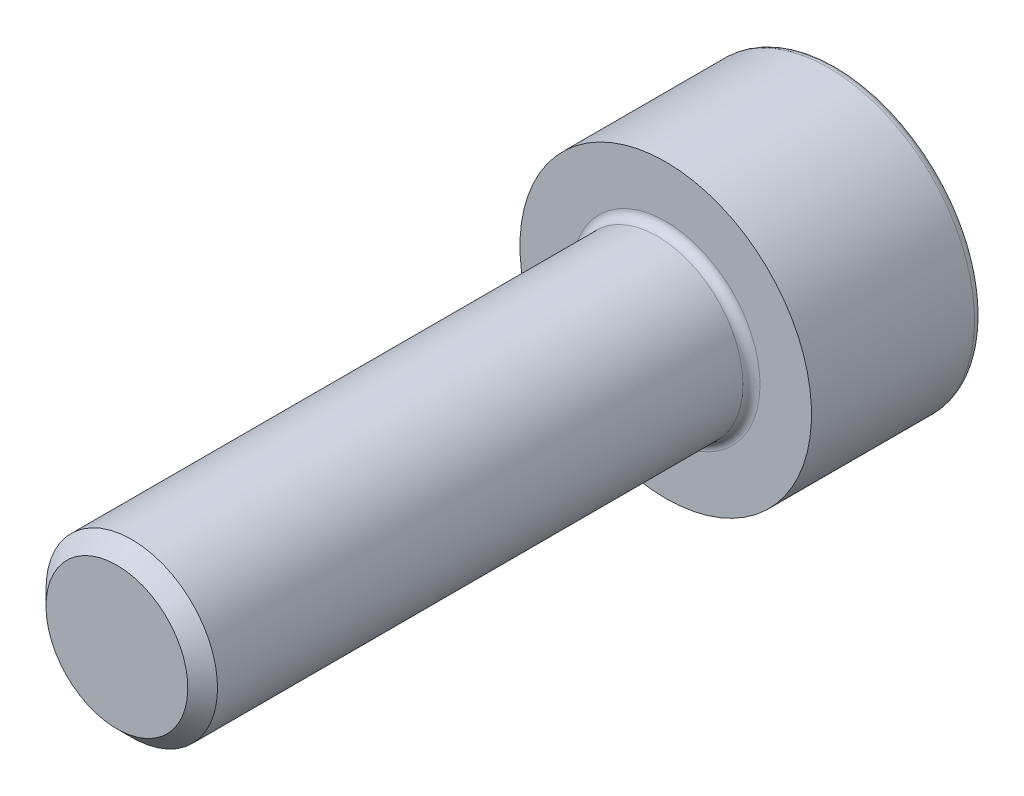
ISO-10303-21;
HEADER;
FILE_DESCRIPTION(('STEP AP214'),'2;1');
FILE_NAME('part.step','',(''),(''),'','','');
FILE_SCHEMA(('AUTOMOTIVE_DESIGN { 1 0 10303 214 1 1 1 1 }'));
ENDSEC;
DATA;
#1=APPLICATION_CONTEXT('core data for automotive mechanical design processes');
#2=APPLICATION_PROTOCOL_DEFINITION('international standard','automotive_design',2000,#1);
#3=PRODUCT_CONTEXT('',#1,'mechanical');
#4=PRODUCT('Part','Part','',(#3));
#5=PRODUCT_RELATED_PRODUCT_CATEGORY('part','',(#4));
#6=PRODUCT_DEFINITION_FORMATION('','',#4);
#7=PRODUCT_DEFINITION_CONTEXT('part definition',#1,'design');
#8=PRODUCT_DEFINITION('design','',#6,#7);
#9=PRODUCT_DEFINITION_SHAPE('','',#8);
#10=(LENGTH_UNIT() NAMED_UNIT(*) SI_UNIT(.MILLI.,.METRE.));
#11=(NAMED_UNIT(*) PLANE_ANGLE_UNIT() SI_UNIT($,.RADIAN.));
#12=(NAMED_UNIT(*) SI_UNIT($,.STERADIAN.) SOLID_ANGLE_UNIT());
#13=UNCERTAINTY_MEASURE_WITH_UNIT(LENGTH_MEASURE(1.E-05),#10,'distance_accuracy_value','');
#14=(GEOMETRIC_REPRESENTATION_CONTEXT(3) GLOBAL_UNCERTAINTY_ASSIGNED_CONTEXT((#13)) GLOBAL_UNIT_ASSIGNED_CONTEXT((#10,
#11,#12)) REPRESENTATION_CONTEXT('',''));
#15=CARTESIAN_POINT('',(0.,0.,0.));
#16=DIRECTION('',(0.,0.,1.));
#17=DIRECTION('',(1.,0.,0.));
#18=AXIS2_PLACEMENT_3D('',#15,#16,#17);
#19=CARTESIAN_POINT('',(0.,2.5,16.));
#20=DIRECTION('',(0.,0.,1.));
#21=DIRECTION('',(0.,-1.,0.));
#22=AXIS2_PLACEMENT_3D('',#19,#20,#21);
#23=PLANE('',#22);
#24=CARTESIAN_POINT('',(0.,0.,16.));
#25=DIRECTION('',(0.,0.,1.));
#26=DIRECTION('',(0.,-1.,0.));
#27=AXIS2_PLACEMENT_3D('',#24,#25,#26);
#28=CIRCLE('',#27,2.067);
#29=CARTESIAN_POINT('',(0.,2.06699999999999,16.));
#30=VERTEX_POINT('',#29);
#31=EDGE_CURVE('E11',#30,#30,#28,.T.);
#32=ORIENTED_EDGE('',*,*,#31,.T.);
#33=EDGE_LOOP('',(#32));
#34=FACE_BOUND('',#33,.T.);
#35=ADVANCED_FACE('F33',(#34),#23,.T.);
#36=CARTESIAN_POINT('',(0.,0.,-5.));
#37=DIRECTION('',(0.,0.,-1.));
#38=DIRECTION('',(0.,1.,0.));
#39=AXIS2_PLACEMENT_3D('',#36,#37,#38);
#40=CYLINDRICAL_SURFACE('',#39,2.5);
#41=CARTESIAN_POINT('',(0.,0.,15.567));
#42=DIRECTION('',(0.,0.,1.));
#43=DIRECTION('',(0.,-1.,0.));
#44=AXIS2_PLACEMENT_3D('',#41,#42,#43);
#45=CIRCLE('',#44,2.5);
#46=CARTESIAN_POINT('',(0.,2.5,15.567));
#47=VERTEX_POINT('',#46);
#48=EDGE_CURVE('E40',#47,#47,#45,.F.);
#49=ORIENTED_EDGE('',*,*,#48,.T.);
#50=EDGE_LOOP('',(#49));
#51=FACE_BOUND('',#50,.T.);
#52=CARTESIAN_POINT('',(0.,0.,0.249999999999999));
#53=DIRECTION('',(0.,0.,1.));
#54=DIRECTION('',(0.,-1.,0.));
#55=AXIS2_PLACEMENT_3D('',#52,#53,#54);
#56=CIRCLE('',#55,2.5);
#57=CARTESIAN_POINT('',(0.,-2.5,0.249999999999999));
#58=VERTEX_POINT('',#57);
#59=EDGE_CURVE('E183',#58,#58,#56,.T.);
#60=ORIENTED_EDGE('',*,*,#59,.T.);
#61=EDGE_LOOP('',(#60));
#62=FACE_BOUND('',#61,.T.);
#63=ADVANCED_FACE('F194',(#51,#62),#40,.T.);
#64=CARTESIAN_POINT('',(0.,4.25,0.));
#65=DIRECTION('',(0.,0.,1.));
#66=DIRECTION('',(0.,-1.,0.));
#67=AXIS2_PLACEMENT_3D('',#64,#65,#66);
#68=PLANE('',#67);
#69=CARTESIAN_POINT('',(0.,0.,0.));
#70=DIRECTION('',(0.,0.,1.));
#71=DIRECTION('',(0.,-1.,0.));
#72=AXIS2_PLACEMENT_3D('',#69,#70,#71);
#73=CIRCLE('',#72,2.75);
#74=CARTESIAN_POINT('',(0.,-2.75,0.));
#75=VERTEX_POINT('',#74);
#76=EDGE_CURVE('E180',#75,#75,#73,.F.);
#77=ORIENTED_EDGE('',*,*,#76,.T.);
#78=EDGE_LOOP('',(#77));
#79=FACE_BOUND('',#78,.T.);
#80=CARTESIAN_POINT('',(0.,0.,0.));
#81=DIRECTION('',(0.,0.,-1.));
#82=DIRECTION('',(0.,1.,0.));
#83=AXIS2_PLACEMENT_3D('',#80,#81,#82);
#84=CIRCLE('',#83,4.25);
#85=CARTESIAN_POINT('',(0.,4.25,0.));
#86=VERTEX_POINT('',#85);
#87=EDGE_CURVE('E176',#86,#86,#84,.T.);
#88=ORIENTED_EDGE('',*,*,#87,.F.);
#89=EDGE_LOOP('',(#88));
#90=FACE_BOUND('',#89,.T.);
#91=ADVANCED_FACE('F214',(#79,#90),#68,.T.);
#92=CARTESIAN_POINT('',(0.,0.,-5.));
#93=DIRECTION('',(0.,0.,-1.));
#94=DIRECTION('',(0.,1.,0.));
#95=AXIS2_PLACEMENT_3D('',#92,#93,#94);
#96=CYLINDRICAL_SURFACE('',#95,4.25);
#97=CARTESIAN_POINT('',(0.,0.,-4.75));
#98=DIRECTION('',(0.,0.,-1.));
#99=DIRECTION('',(0.,1.,0.));
#100=AXIS2_PLACEMENT_3D('',#97,#98,#99);
#101=CIRCLE('',#100,4.25);
#102=CARTESIAN_POINT('',(0.,4.25,-4.75));
#103=VERTEX_POINT('',#102);
#104=EDGE_CURVE('E189',#103,#103,#101,.F.);
#105=ORIENTED_EDGE('',*,*,#104,.T.);
#106=EDGE_LOOP('',(#105));
#107=FACE_BOUND('',#106,.T.);
#108=ORIENTED_EDGE('',*,*,#87,.T.);
#109=EDGE_LOOP('',(#108));
#110=FACE_BOUND('',#109,.T.);
#111=ADVANCED_FACE('F218',(#107,#110),#96,.T.);
#112=CARTESIAN_POINT('',(0.,0.,-5.));
#113=DIRECTION('',(0.,0.,-1.));
#114=DIRECTION('',(0.,1.,0.));
#115=AXIS2_PLACEMENT_3D('',#112,#113,#114);
#116=PLANE('',#115);
#117=CARTESIAN_POINT('',(0.,0.,-5.));
#118=DIRECTION('',(0.,0.,-1.));
#119=DIRECTION('',(0.,1.,0.));
#120=AXIS2_PLACEMENT_3D('',#117,#118,#119);
#121=CIRCLE('',#120,4.);
#122=CARTESIAN_POINT('',(0.,4.,-5.));
#123=VERTEX_POINT('',#122);
#124=EDGE_CURVE('E186',#123,#123,#121,.T.);
#125=ORIENTED_EDGE('',*,*,#124,.T.);
#126=EDGE_LOOP('',(#125));
#127=FACE_BOUND('',#126,.T.);
#128=DIRECTION('',(-1.,0.,0.));
#129=VECTOR('',#128,1.);
#130=CARTESIAN_POINT('',(1.15470053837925,-2.,-5.));
#131=LINE('',#130,#129);
#132=CARTESIAN_POINT('',(1.15470053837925,-2.,-5.));
#133=VERTEX_POINT('',#132);
#134=CARTESIAN_POINT('',(-1.15470053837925,-2.,-5.));
#135=VERTEX_POINT('',#134);
#136=EDGE_CURVE('E137',#133,#135,#131,.T.);
#137=ORIENTED_EDGE('',*,*,#136,.F.);
#138=DIRECTION('',(-0.499999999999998,-0.86602540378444,0.));
#139=VECTOR('',#138,1.);
#140=CARTESIAN_POINT('',(2.30940107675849,0.,-5.));
#141=LINE('',#140,#139);
#142=CARTESIAN_POINT('',(2.30940107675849,0.,-5.));
#143=VERTEX_POINT('',#142);
#144=EDGE_CURVE('E132',#143,#133,#141,.T.);
#145=ORIENTED_EDGE('',*,*,#144,.F.);
#146=DIRECTION('',(0.499999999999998,-0.86602540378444,0.));
#147=VECTOR('',#146,1.);
#148=CARTESIAN_POINT('',(1.15470053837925,2.,-5.));
#149=LINE('',#148,#147);
#150=CARTESIAN_POINT('',(1.15470053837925,2.,-5.));
#151=VERTEX_POINT('',#150);
#152=EDGE_CURVE('E130',#151,#143,#149,.T.);
#153=ORIENTED_EDGE('',*,*,#152,.F.);
#154=DIRECTION('',(1.,0.,0.));
#155=VECTOR('',#154,1.);
#156=CARTESIAN_POINT('',(-1.15470053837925,2.,-5.));
#157=LINE('',#156,#155);
#158=CARTESIAN_POINT('',(-1.15470053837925,2.,-5.));
#159=VERTEX_POINT('',#158);
#160=EDGE_CURVE('E115',#159,#151,#157,.T.);
#161=ORIENTED_EDGE('',*,*,#160,.F.);
#162=DIRECTION('',(0.499999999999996,0.866025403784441,0.));
#163=VECTOR('',#162,1.);
#164=CARTESIAN_POINT('',(-2.30940107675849,0.,-5.));
#165=LINE('',#164,#163);
#166=CARTESIAN_POINT('',(-2.30940107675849,0.,-5.));
#167=VERTEX_POINT('',#166);
#168=EDGE_CURVE('E103',#167,#159,#165,.T.);
#169=ORIENTED_EDGE('',*,*,#168,.F.);
#170=DIRECTION('',(-0.499999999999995,0.866025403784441,0.));
#171=VECTOR('',#170,1.);
#172=CARTESIAN_POINT('',(-1.15470053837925,-2.,-5.));
#173=LINE('',#172,#171);
#174=EDGE_CURVE('E140',#135,#167,#173,.T.);
#175=ORIENTED_EDGE('',*,*,#174,.F.);
#176=EDGE_LOOP('',(#137,#145,#153,#161,#169,#175));
#177=FACE_BOUND('',#176,.T.);
#178=ADVANCED_FACE('F128',(#127,#177),#116,.T.);
#179=CARTESIAN_POINT('',(-2.30940107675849,0.,-2.5));
#180=DIRECTION('',(-0.866025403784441,0.499999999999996,0.));
#181=DIRECTION('',(-0.499999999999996,-0.866025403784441,0.));
#182=AXIS2_PLACEMENT_3D('',#179,#180,#181);
#183=PLANE('',#182);
#184=ORIENTED_EDGE('',*,*,#168,.T.);
#185=DIRECTION('',(0.,0.,-1.));
#186=VECTOR('',#185,1.);
#187=CARTESIAN_POINT('',(-1.15470053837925,2.,-2.5));
#188=LINE('',#187,#186);
#189=CARTESIAN_POINT('',(-1.15470053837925,2.,-2.5));
#190=VERTEX_POINT('',#189);
#191=EDGE_CURVE('E107',#190,#159,#188,.T.);
#192=ORIENTED_EDGE('',*,*,#191,.F.);
#193=DIRECTION('',(0.499999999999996,0.866025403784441,0.));
#194=VECTOR('',#193,1.);
#195=CARTESIAN_POINT('',(-2.30940107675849,0.,-2.5));
#196=LINE('',#195,#194);
#197=CARTESIAN_POINT('',(-1.73205080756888,0.99999999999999,-2.5));
#198=VERTEX_POINT('',#197);
#199=EDGE_CURVE('E142',#198,#190,#196,.T.);
#200=ORIENTED_EDGE('',*,*,#199,.F.);
#201=CARTESIAN_POINT('',(-2.30940107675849,0.,-2.5));
#202=VERTEX_POINT('',#201);
#203=EDGE_CURVE('E143',#202,#198,#196,.T.);
#204=ORIENTED_EDGE('',*,*,#203,.F.);
#205=DIRECTION('',(0.,0.,-1.));
#206=VECTOR('',#205,1.);
#207=CARTESIAN_POINT('',(-2.30940107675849,0.,-2.5));
#208=LINE('',#207,#206);
#209=EDGE_CURVE('E111',#202,#167,#208,.T.);
#210=ORIENTED_EDGE('',*,*,#209,.T.);
#211=EDGE_LOOP('',(#184,#192,#200,#204,#210));
#212=FACE_BOUND('',#211,.T.);
#213=ADVANCED_FACE('F105',(#212),#183,.F.);
#214=CARTESIAN_POINT('',(-1.15470053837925,-2.,-2.5));
#215=DIRECTION('',(-0.866025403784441,-0.499999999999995,0.));
#216=DIRECTION('',(0.499999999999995,-0.866025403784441,0.));
#217=AXIS2_PLACEMENT_3D('',#214,#215,#216);
#218=PLANE('',#217);
#219=ORIENTED_EDGE('',*,*,#174,.T.);
#220=ORIENTED_EDGE('',*,*,#209,.F.);
#221=DIRECTION('',(-0.499999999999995,0.866025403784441,0.));
#222=VECTOR('',#221,1.);
#223=CARTESIAN_POINT('',(-1.15470053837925,-2.,-2.5));
#224=LINE('',#223,#222);
#225=CARTESIAN_POINT('',(-1.73205080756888,-0.999999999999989,-2.5));
#226=VERTEX_POINT('',#225);
#227=EDGE_CURVE('E158',#226,#202,#224,.T.);
#228=ORIENTED_EDGE('',*,*,#227,.F.);
#229=CARTESIAN_POINT('',(-1.15470053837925,-2.,-2.5));
#230=VERTEX_POINT('',#229);
#231=EDGE_CURVE('E126',#230,#226,#224,.T.);
#232=ORIENTED_EDGE('',*,*,#231,.F.);
#233=DIRECTION('',(0.,0.,-1.));
#234=VECTOR('',#233,1.);
#235=CARTESIAN_POINT('',(-1.15470053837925,-2.,-2.5));
#236=LINE('',#235,#234);
#237=EDGE_CURVE('E163',#230,#135,#236,.T.);
#238=ORIENTED_EDGE('',*,*,#237,.T.);
#239=EDGE_LOOP('',(#219,#220,#228,#232,#238));
#240=FACE_BOUND('',#239,.T.);
#241=ADVANCED_FACE('F234',(#240),#218,.F.);
#242=CARTESIAN_POINT('',(1.15470053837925,-2.,-2.5));
#243=DIRECTION('',(0.,-1.,0.));
#244=DIRECTION('',(0.,0.,-1.));
#245=AXIS2_PLACEMENT_3D('',#242,#243,#244);
#246=PLANE('',#245);
#247=ORIENTED_EDGE('',*,*,#136,.T.);
#248=ORIENTED_EDGE('',*,*,#237,.F.);
#249=DIRECTION('',(-1.,0.,0.));
#250=VECTOR('',#249,1.);
#251=CARTESIAN_POINT('',(1.15470053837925,-2.,-2.5));
#252=LINE('',#251,#250);
#253=CARTESIAN_POINT('',(0.,-2.,-2.5));
#254=VERTEX_POINT('',#253);
#255=EDGE_CURVE('E154',#254,#230,#252,.T.);
#256=ORIENTED_EDGE('',*,*,#255,.F.);
#257=CARTESIAN_POINT('',(1.15470053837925,-2.,-2.5));
#258=VERTEX_POINT('',#257);
#259=EDGE_CURVE('E155',#258,#254,#252,.T.);
#260=ORIENTED_EDGE('',*,*,#259,.F.);
#261=DIRECTION('',(0.,0.,-1.));
#262=VECTOR('',#261,1.);
#263=CARTESIAN_POINT('',(1.15470053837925,-2.,-2.5));
#264=LINE('',#263,#262);
#265=EDGE_CURVE('E166',#258,#133,#264,.T.);
#266=ORIENTED_EDGE('',*,*,#265,.T.);
#267=EDGE_LOOP('',(#247,#248,#256,#260,#266));
#268=FACE_BOUND('',#267,.T.);
#269=ADVANCED_FACE('F245',(#268),#246,.F.);
#270=CARTESIAN_POINT('',(2.30940107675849,0.,-2.5));
#271=DIRECTION('',(0.86602540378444,-0.499999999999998,0.));
#272=DIRECTION('',(0.499999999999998,0.86602540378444,0.));
#273=AXIS2_PLACEMENT_3D('',#270,#271,#272);
#274=PLANE('',#273);
#275=ORIENTED_EDGE('',*,*,#144,.T.);
#276=ORIENTED_EDGE('',*,*,#265,.F.);
#277=DIRECTION('',(-0.499999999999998,-0.86602540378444,0.));
#278=VECTOR('',#277,1.);
#279=CARTESIAN_POINT('',(2.30940107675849,0.,-2.5));
#280=LINE('',#279,#278);
#281=CARTESIAN_POINT('',(1.73205080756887,-0.999999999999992,-2.5));
#282=VERTEX_POINT('',#281);
#283=EDGE_CURVE('E150',#282,#258,#280,.T.);
#284=ORIENTED_EDGE('',*,*,#283,.F.);
#285=CARTESIAN_POINT('',(2.30940107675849,0.,-2.5));
#286=VERTEX_POINT('',#285);
#287=EDGE_CURVE('E151',#286,#282,#280,.T.);
#288=ORIENTED_EDGE('',*,*,#287,.F.);
#289=DIRECTION('',(0.,0.,-1.));
#290=VECTOR('',#289,1.);
#291=CARTESIAN_POINT('',(2.30940107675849,0.,-2.5));
#292=LINE('',#291,#290);
#293=EDGE_CURVE('E169',#286,#143,#292,.T.);
#294=ORIENTED_EDGE('',*,*,#293,.T.);
#295=EDGE_LOOP('',(#275,#276,#284,#288,#294));
#296=FACE_BOUND('',#295,.T.);
#297=ADVANCED_FACE('F241',(#296),#274,.F.);
#298=CARTESIAN_POINT('',(1.15470053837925,2.,-2.5));
#299=DIRECTION('',(0.86602540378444,0.499999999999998,0.));
#300=DIRECTION('',(-0.499999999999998,0.86602540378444,0.));
#301=AXIS2_PLACEMENT_3D('',#298,#299,#300);
#302=PLANE('',#301);
#303=ORIENTED_EDGE('',*,*,#152,.T.);
#304=ORIENTED_EDGE('',*,*,#293,.F.);
#305=DIRECTION('',(0.499999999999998,-0.86602540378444,0.));
#306=VECTOR('',#305,1.);
#307=CARTESIAN_POINT('',(1.15470053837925,2.,-2.5));
#308=LINE('',#307,#306);
#309=CARTESIAN_POINT('',(1.73205080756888,0.999999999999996,-2.5));
#310=VERTEX_POINT('',#309);
#311=EDGE_CURVE('E148',#310,#286,#308,.T.);
#312=ORIENTED_EDGE('',*,*,#311,.F.);
#313=CARTESIAN_POINT('',(1.15470053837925,2.,-2.5));
#314=VERTEX_POINT('',#313);
#315=EDGE_CURVE('E47',#314,#310,#308,.T.);
#316=ORIENTED_EDGE('',*,*,#315,.F.);
#317=DIRECTION('',(0.,0.,-1.));
#318=VECTOR('',#317,1.);
#319=CARTESIAN_POINT('',(1.15470053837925,2.,-2.5));
#320=LINE('',#319,#318);
#321=EDGE_CURVE('E125',#314,#151,#320,.T.);
#322=ORIENTED_EDGE('',*,*,#321,.T.);
#323=EDGE_LOOP('',(#303,#304,#312,#316,#322));
#324=FACE_BOUND('',#323,.T.);
#325=ADVANCED_FACE('F238',(#324),#302,.F.);
#326=CARTESIAN_POINT('',(-1.15470053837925,2.,-2.5));
#327=DIRECTION('',(0.,1.,0.));
#328=DIRECTION('',(0.,0.,1.));
#329=AXIS2_PLACEMENT_3D('',#326,#327,#328);
#330=PLANE('',#329);
#331=ORIENTED_EDGE('',*,*,#160,.T.);
#332=ORIENTED_EDGE('',*,*,#321,.F.);
#333=DIRECTION('',(1.,0.,0.));
#334=VECTOR('',#333,1.);
#335=CARTESIAN_POINT('',(-1.15470053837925,2.,-2.5));
#336=LINE('',#335,#334);
#337=CARTESIAN_POINT('',(0.,2.,-2.5));
#338=VERTEX_POINT('',#337);
#339=EDGE_CURVE('E146',#338,#314,#336,.T.);
#340=ORIENTED_EDGE('',*,*,#339,.F.);
#341=EDGE_CURVE('E124',#190,#338,#336,.T.);
#342=ORIENTED_EDGE('',*,*,#341,.F.);
#343=ORIENTED_EDGE('',*,*,#191,.T.);
#344=EDGE_LOOP('',(#331,#332,#340,#342,#343));
#345=FACE_BOUND('',#344,.T.);
#346=ADVANCED_FACE('F119',(#345),#330,.F.);
#347=CARTESIAN_POINT('',(-1.15470053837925,2.,-2.5));
#348=DIRECTION('',(0.,0.,-1.));
#349=DIRECTION('',(0.,1.,0.));
#350=AXIS2_PLACEMENT_3D('',#347,#348,#349);
#351=PLANE('',#350);
#352=CARTESIAN_POINT('',(0.,0.,-2.5));
#353=DIRECTION('',(0.,0.,-1.));
#354=DIRECTION('',(0.,1.,0.));
#355=AXIS2_PLACEMENT_3D('',#352,#353,#354);
#356=CIRCLE('',#355,2.);
#357=EDGE_CURVE('E162',#198,#338,#356,.T.);
#358=ORIENTED_EDGE('',*,*,#357,.F.);
#359=ORIENTED_EDGE('',*,*,#199,.T.);
#360=ORIENTED_EDGE('',*,*,#341,.T.);
#361=EDGE_LOOP('',(#358,#359,#360));
#362=FACE_BOUND('',#361,.T.);
#363=ADVANCED_FACE('F237',(#362),#351,.T.);
#364=EDGE_CURVE('E402',#226,#198,#356,.T.);
#365=ORIENTED_EDGE('',*,*,#364,.F.);
#366=ORIENTED_EDGE('',*,*,#227,.T.);
#367=ORIENTED_EDGE('',*,*,#203,.T.);
#368=EDGE_LOOP('',(#365,#366,#367));
#369=FACE_BOUND('',#368,.T.);
#370=ADVANCED_FACE('F255',(#369),#351,.T.);
#371=EDGE_CURVE('E403',#254,#226,#356,.T.);
#372=ORIENTED_EDGE('',*,*,#371,.F.);
#373=ORIENTED_EDGE('',*,*,#255,.T.);
#374=ORIENTED_EDGE('',*,*,#231,.T.);
#375=EDGE_LOOP('',(#372,#373,#374));
#376=FACE_BOUND('',#375,.T.);
#377=ADVANCED_FACE('F351',(#376),#351,.T.);
#378=EDGE_CURVE('E404',#282,#254,#356,.T.);
#379=ORIENTED_EDGE('',*,*,#378,.F.);
#380=ORIENTED_EDGE('',*,*,#283,.T.);
#381=ORIENTED_EDGE('',*,*,#259,.T.);
#382=EDGE_LOOP('',(#379,#380,#381));
#383=FACE_BOUND('',#382,.T.);
#384=ADVANCED_FACE('F359',(#383),#351,.T.);
#385=EDGE_CURVE('E177',#310,#282,#356,.T.);
#386=ORIENTED_EDGE('',*,*,#385,.F.);
#387=ORIENTED_EDGE('',*,*,#311,.T.);
#388=ORIENTED_EDGE('',*,*,#287,.T.);
#389=EDGE_LOOP('',(#386,#387,#388));
#390=FACE_BOUND('',#389,.T.);
#391=ADVANCED_FACE('F367',(#390),#351,.T.);
#392=EDGE_CURVE('E173',#338,#310,#356,.T.);
#393=ORIENTED_EDGE('',*,*,#392,.F.);
#394=ORIENTED_EDGE('',*,*,#339,.T.);
#395=ORIENTED_EDGE('',*,*,#315,.T.);
#396=EDGE_LOOP('',(#393,#394,#395));
#397=FACE_BOUND('',#396,.T.);
#398=ADVANCED_FACE('F231',(#397),#351,.T.);
#399=CARTESIAN_POINT('',(0.,0.,-2.5));
#400=DIRECTION('',(0.,0.,-1.));
#401=DIRECTION('',(0.,1.,0.));
#402=AXIS2_PLACEMENT_3D('',#399,#400,#401);
#403=CONICAL_SURFACE('',#402,2.,1.0471975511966);
#404=CARTESIAN_POINT('',(0.,0.,-1.34529946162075));
#405=VERTEX_POINT('',#404);
#406=VERTEX_LOOP('',#405);
#407=FACE_BOUND('',#406,.T.);
#408=ORIENTED_EDGE('',*,*,#392,.T.);
#409=ORIENTED_EDGE('',*,*,#385,.T.);
#410=ORIENTED_EDGE('',*,*,#378,.T.);
#411=ORIENTED_EDGE('',*,*,#371,.T.);
#412=ORIENTED_EDGE('',*,*,#364,.T.);
#413=ORIENTED_EDGE('',*,*,#357,.T.);
#414=EDGE_LOOP('',(#408,#409,#410,#411,#412,#413));
#415=FACE_BOUND('',#414,.T.);
#416=ADVANCED_FACE('F228',(#407,#415),#403,.F.);
#417=CARTESIAN_POINT('',(0.,0.,0.249999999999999));
#418=DIRECTION('',(0.,0.,1.));
#419=DIRECTION('',(0.,-1.,0.));
#420=AXIS2_PLACEMENT_3D('',#417,#418,#419);
#421=TOROIDAL_SURFACE('',#420,2.75,0.25);
#422=ORIENTED_EDGE('',*,*,#59,.F.);
#423=EDGE_LOOP('',(#422));
#424=FACE_BOUND('',#423,.T.);
#425=ORIENTED_EDGE('',*,*,#76,.F.);
#426=EDGE_LOOP('',(#425));
#427=FACE_BOUND('',#426,.T.);
#428=ADVANCED_FACE('F205',(#424,#427),#421,.F.);
#429=CARTESIAN_POINT('',(0.,0.,-4.75));
#430=DIRECTION('',(0.,0.,-1.));
#431=DIRECTION('',(0.,1.,0.));
#432=AXIS2_PLACEMENT_3D('',#429,#430,#431);
#433=TOROIDAL_SURFACE('',#432,4.,0.25);
#434=ORIENTED_EDGE('',*,*,#104,.F.);
#435=EDGE_LOOP('',(#434));
#436=FACE_BOUND('',#435,.T.);
#437=ORIENTED_EDGE('',*,*,#124,.F.);
#438=EDGE_LOOP('',(#437));
#439=FACE_BOUND('',#438,.T.);
#440=ADVANCED_FACE('F199',(#436,#439),#433,.T.);
#441=CARTESIAN_POINT('',(0.,0.,15.567));
#442=DIRECTION('',(0.,0.,-1.));
#443=DIRECTION('',(0.,1.,0.));
#444=AXIS2_PLACEMENT_3D('',#441,#442,#443);
#445=CONICAL_SURFACE('',#444,2.5,0.785398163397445);
#446=CARTESIAN_POINT('',(0.,2.06699999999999,16.));
#447=CARTESIAN_POINT('',(0.,2.07151041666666,15.9954895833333));
#448=CARTESIAN_POINT('',(0.,2.07602083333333,15.9909791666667));
#449=CARTESIAN_POINT('',(0.,2.08504166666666,15.9819583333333));
#450=CARTESIAN_POINT('',(0.,2.08955208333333,15.9774479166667));
#451=CARTESIAN_POINT('',(0.,2.09857291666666,15.9684270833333));
#452=CARTESIAN_POINT('',(0.,2.10308333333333,15.9639166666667));
#453=CARTESIAN_POINT('',(0.,2.11210416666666,15.9548958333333));
#454=CARTESIAN_POINT('',(0.,2.11661458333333,15.9503854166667));
#455=CARTESIAN_POINT('',(0.,2.12563541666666,15.9413645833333));
#456=CARTESIAN_POINT('',(0.,2.13014583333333,15.9368541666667));
#457=CARTESIAN_POINT('',(0.,2.13916666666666,15.9278333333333));
#458=CARTESIAN_POINT('',(0.,2.14367708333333,15.9233229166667));
#459=CARTESIAN_POINT('',(0.,2.15269791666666,15.9143020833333));
#460=CARTESIAN_POINT('',(0.,2.15720833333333,15.9097916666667));
#461=CARTESIAN_POINT('',(0.,2.16622916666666,15.9007708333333));
#462=CARTESIAN_POINT('',(0.,2.17073958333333,15.8962604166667));
#463=CARTESIAN_POINT('',(0.,2.17976041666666,15.8872395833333));
#464=CARTESIAN_POINT('',(0.,2.18427083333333,15.8827291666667));
#465=CARTESIAN_POINT('',(0.,2.19329166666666,15.8737083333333));
#466=CARTESIAN_POINT('',(0.,2.19780208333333,15.8691979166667));
#467=CARTESIAN_POINT('',(0.,2.20682291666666,15.8601770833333));
#468=CARTESIAN_POINT('',(0.,2.21133333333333,15.8556666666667));
#469=CARTESIAN_POINT('',(0.,2.22035416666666,15.8466458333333));
#470=CARTESIAN_POINT('',(0.,2.22486458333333,15.8421354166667));
#471=CARTESIAN_POINT('',(0.,2.23388541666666,15.8331145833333));
#472=CARTESIAN_POINT('',(0.,2.23839583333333,15.8286041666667));
#473=CARTESIAN_POINT('',(0.,2.24741666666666,15.8195833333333));
#474=CARTESIAN_POINT('',(0.,2.25192708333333,15.8150729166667));
#475=CARTESIAN_POINT('',(0.,2.26094791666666,15.8060520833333));
#476=CARTESIAN_POINT('',(0.,2.26545833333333,15.8015416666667));
#477=CARTESIAN_POINT('',(0.,2.27447916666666,15.7925208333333));
#478=CARTESIAN_POINT('',(0.,2.27898958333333,15.7880104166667));
#479=CARTESIAN_POINT('',(0.,2.28801041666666,15.7789895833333));
#480=CARTESIAN_POINT('',(0.,2.29252083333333,15.7744791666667));
#481=CARTESIAN_POINT('',(0.,2.30154166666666,15.7654583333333));
#482=CARTESIAN_POINT('',(0.,2.30605208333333,15.7609479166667));
#483=CARTESIAN_POINT('',(0.,2.31507291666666,15.7519270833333));
#484=CARTESIAN_POINT('',(0.,2.31958333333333,15.7474166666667));
#485=CARTESIAN_POINT('',(0.,2.32860416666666,15.7383958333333));
#486=CARTESIAN_POINT('',(0.,2.33311458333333,15.7338854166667));
#487=CARTESIAN_POINT('',(0.,2.34213541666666,15.7248645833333));
#488=CARTESIAN_POINT('',(0.,2.34664583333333,15.7203541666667));
#489=CARTESIAN_POINT('',(0.,2.35566666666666,15.7113333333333));
#490=CARTESIAN_POINT('',(0.,2.36017708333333,15.7068229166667));
#491=CARTESIAN_POINT('',(0.,2.36919791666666,15.6978020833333));
#492=CARTESIAN_POINT('',(0.,2.37370833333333,15.6932916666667));
#493=CARTESIAN_POINT('',(0.,2.38272916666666,15.6842708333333));
#494=CARTESIAN_POINT('',(0.,2.38723958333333,15.6797604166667));
#495=CARTESIAN_POINT('',(0.,2.39626041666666,15.6707395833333));
#496=CARTESIAN_POINT('',(0.,2.40077083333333,15.6662291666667));
#497=CARTESIAN_POINT('',(0.,2.40979166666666,15.6572083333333));
#498=CARTESIAN_POINT('',(0.,2.41430208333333,15.6526979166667));
#499=CARTESIAN_POINT('',(0.,2.42332291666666,15.6436770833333));
#500=CARTESIAN_POINT('',(0.,2.42783333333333,15.6391666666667));
#501=CARTESIAN_POINT('',(0.,2.43685416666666,15.6301458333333));
#502=CARTESIAN_POINT('',(0.,2.44136458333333,15.6256354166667));
#503=CARTESIAN_POINT('',(0.,2.45038541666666,15.6166145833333));
#504=CARTESIAN_POINT('',(0.,2.45489583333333,15.6121041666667));
#505=CARTESIAN_POINT('',(0.,2.46391666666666,15.6030833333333));
#506=CARTESIAN_POINT('',(0.,2.46842708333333,15.5985729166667));
#507=CARTESIAN_POINT('',(0.,2.47744791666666,15.5895520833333));
#508=CARTESIAN_POINT('',(0.,2.48195833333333,15.5850416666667));
#509=CARTESIAN_POINT('',(0.,2.49097916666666,15.5760208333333));
#510=CARTESIAN_POINT('',(0.,2.49548958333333,15.5715104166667));
#511=CARTESIAN_POINT('',(0.,2.5,15.567));
#512=B_SPLINE_CURVE_WITH_KNOTS('',3,(#446,#447,#448,#449,#450,#451,#452,#453,#454,#455,#456,
#457,#458,#459,#460,#461,#462,#463,#464,#465,#466,#467,#468,#469,#470,#471,#472,#473,#474,#475,
#476,#477,#478,#479,#480,#481,#482,#483,#484,#485,#486,#487,#488,#489,#490,#491,#492,#493,#494,
#495,#496,#497,#498,#499,#500,#501,#502,#503,#504,#505,#506,#507,#508,#509,#510,#511),
.UNSPECIFIED.,.F.,.F.,(4,2,2,2,2,2,2,2,2,2,2,2,2,2,2,2,2,2,2,2,2,2,2,2,2,2,2,2,2,2,2,2,4),(0.,
0.0191360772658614,0.0382721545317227,0.0574082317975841,0.0765443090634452,0.0956803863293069,
0.114816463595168,0.13395254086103,0.153088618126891,0.172224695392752,0.191360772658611,
0.210496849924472,0.229632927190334,0.248769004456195,0.267905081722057,0.287041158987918,
0.306177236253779,0.325313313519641,0.344449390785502,0.363585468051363,0.382721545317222,
0.401857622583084,0.420993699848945,0.440129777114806,0.459265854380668,0.478401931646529,
0.49753800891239,0.516674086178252,0.535810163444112,0.554946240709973,0.574082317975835,
0.593218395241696,0.612354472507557),.UNSPECIFIED.);
#513=EDGE_CURVE('BSEAM197',#30,#47,#512,.T.);
#514=ORIENTED_EDGE('',*,*,#31,.F.);
#515=ORIENTED_EDGE('',*,*,#48,.F.);
#516=ORIENTED_EDGE('',*,*,#513,.T.);
#517=ORIENTED_EDGE('',*,*,#513,.F.);
#518=EDGE_LOOP('',(#514,#516,#515,#517));
#519=FACE_BOUND('',#518,.T.);
#520=ADVANCED_FACE('F197',(#519),#445,.T.);
#521=CLOSED_SHELL('',(#35,#63,#91,#111,#178,#213,#241,#269,#297,#325,#346,#363,#370,#377,#384,
#391,#398,#416,#428,#440,#520));
#522=MANIFOLD_SOLID_BREP('B2',#521);
#523=ADVANCED_BREP_SHAPE_REPRESENTATION('',(#18,#522),#14);
#524=SHAPE_DEFINITION_REPRESENTATION(#9,#523);
ENDSEC;
END-ISO-10303-21;
